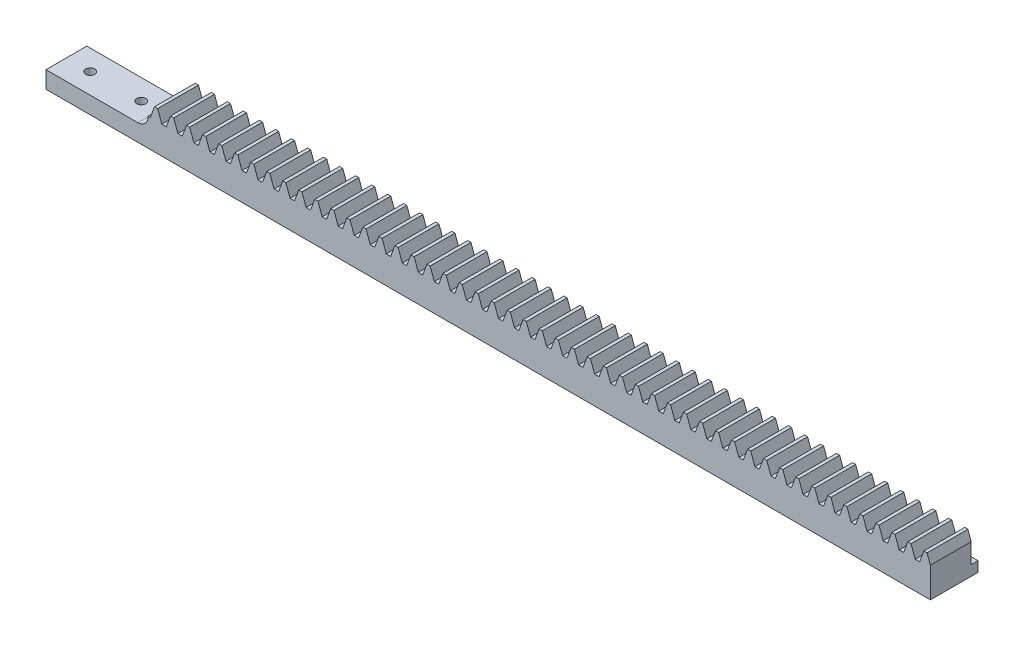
from build123d import *

# Parameters (mm, degrees)
BLANKSKE_W          = 230
BLANKSKE_H          = 11.5
BLANK_DEPTH         = 12
TOOTHCUTSIM_DEPTH   = 231.599761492
TEETHCUTS_COUNT     = 50
TEETHCUTS_PITCH     = 4.712388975
SKETCH3_W           = 208.959955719
SKETCH3_H           = 3
BOSS_EXTRUDE3_DEPTH = 2
SKETCH9_W           = 12
SKETCH9_H           = 5
BOSS_EXTRUDE7_DEPTH = 30
SKETCH10_R          = 1.35
CUT_EXTRUDE4_DEPTH  = 10
FILLET8_R           = 3


with BuildPart() as part:
    # BlankSke → Blank (new body)
    with BuildSketch(Plane.XY):
        with Locations((115, 5.75)):
            Rectangle(BLANKSKE_W, BLANKSKE_H)
    extrude(amount=-BLANK_DEPTH)

    # TooCutSkeSim → ToothCutSim (cut, through all)
    with BuildSketch(Plane.XY):
        Polygon((0.654653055, 8.125), (-0.654653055, 8.125), (-1.892297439, 11.5254), (1.892297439, 11.5254), align=None)
    toothcutsim = extrude(amount=-TOOTHCUTSIM_DEPTH, mode=Mode.SUBTRACT)

    # TeethCuts: ToothCutSim ×50
    with Locations(*[(i * TEETHCUTS_PITCH, 0, 0) for i in range(1, TEETHCUTS_COUNT)]):
        add(toothcutsim, mode=Mode.SUBTRACT)

    # Sketch3 → Boss-Extrude3 (add)
    with BuildSketch(Plane(origin=(0, 0, -12), x_dir=(-1, 0, 0), z_dir=(0, 0, -1))):
        with Locations((-125.520022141, 1.5)):
            Rectangle(SKETCH3_W, SKETCH3_H)
    extrude(amount=BOSS_EXTRUDE3_DEPTH)

    # Sketch9 → Boss-Extrude7 (add)
    with BuildSketch(Plane.ZY):
        with Locations((-6, 2.5)):
            Rectangle(SKETCH9_W, SKETCH9_H)
    extrude(amount=BOSS_EXTRUDE7_DEPTH)

    # Sketch10 → Cut-Extrude4 (cut)
    with BuildSketch(Plane(origin=(0, 5, 0), x_dir=(1, 0, 0), z_dir=(0, 1, 0))):
        with Locations(Location((-8, 6, 0), (0, 0, 270))):
            Circle(SKETCH10_R)
        with Locations(Location((-23, 6, 0), (0, 0, 270))):
            Circle(SKETCH10_R)
    extrude(amount=-CUT_EXTRUDE4_DEPTH, mode=Mode.SUBTRACT)

    # Fillet8
    fillet8_edges = [part.edges().sort_by_distance(p)[0] for p in [
        (0, 5, -6),
    ]]
    fillet(fillet8_edges, radius=FILLET8_R)


solid = part.part
